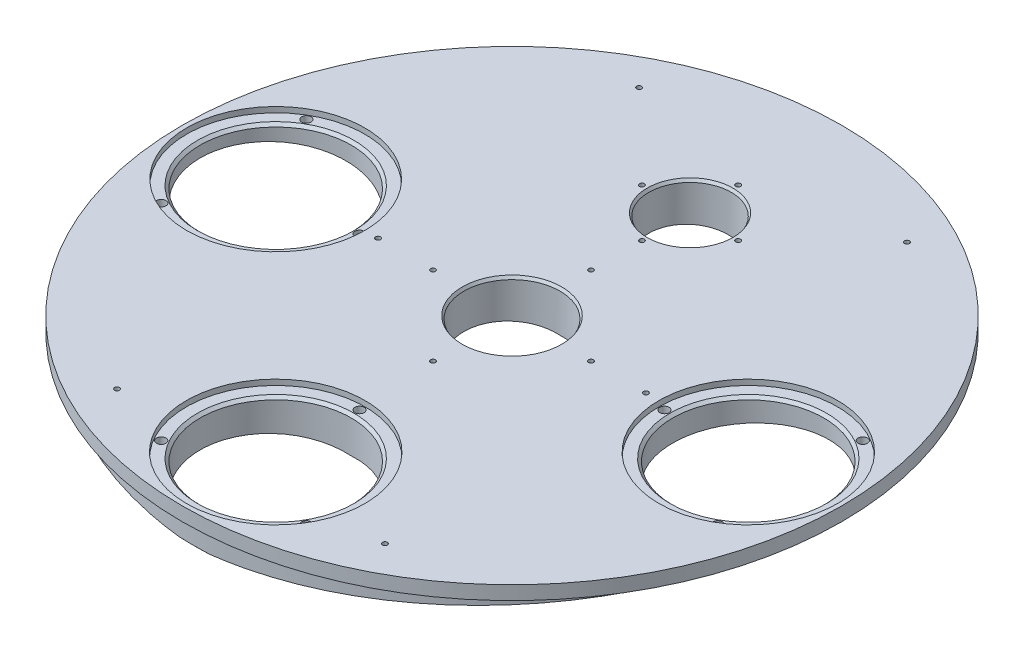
from build123d import *

# Parameters (mm, degrees)
SKETCH2_R                    = 152.4
EXTRUDE2_DEPTH               = 19.05
SKETCH1_R                    = 153.67
SKETCH1_R_2                  = 147.066
CUT_EXTRUDE3_DEPTH           = 12.7
FILLET1_R                    = 0.254
CHAMFER1_SIZE                = 0.508
SKETCH5_R                    = 34.925
CUT_EXTRUDE2_DEPTH           = 217.366407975
CUT_EXTRUDE4_DEPTH           = 12.7
CUT_EXTRUDE5_DEPTH           = 12.7
SKETCH8_R                    = 19.05
OPTODE_PORT_DEPTH            = 19.05
SKETCH9_R                    = 22.225
STIRER_PORT_DEPTH            = 19.05
F_4_40_TAPPED_HOLE2_D        = 2.2606
CIRPATTERN1_COUNT            = 4
CHAMFER2_SIZE                = 0.762
CHAMFER2_SIZE2               = 1.319822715
CHAMFER3_SIZE                = 0.762
CHAMFER3_SIZE2               = 1.319822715
F_4_40_TAPPED_HOLE1_D        = 2.2606
CIRPATTERN2_COUNT            = 4
F_18_0_1695_DIAMETER_HOLE1_D = 4.3053
CIRPATTERN3_COUNT            = 3
MIRROR1_COPY_1_D             = 4.3053
MIRROR1_COPY_2_D             = 4.3053
F_18_0_1695_DIAMETER_HOLE2_D = 4.3053
CIRPATTERN4_COUNT            = 3
F_4_40_TAPPED_HOLE3_D        = 2.2606
LPATTERN1_COUNT              = 2
LPATTERN1_PITCH              = 123.8504
LPATTERN1_COUNT_DIR2         = 3
LPATTERN1_PITCH_DIR2         = 120.65
CHAMFER4_SIZE                = 1.27
SKETCH21_R                   = 41.275
SKETCH21_R_2                 = 41.148
CUT_EXTRUDE8_DEPTH           = 2.54
CHAMFER5_SIZE                = 1.27


with BuildPart() as part:
    # Sketch2 → Extrude2 (new body)
    with BuildSketch(Plane(origin=(0, 0, 0), x_dir=(-1, 0, 0), z_dir=(0, 1, 0))):
        with Locations(Location((0, 0, 0), (0, 0, 270))):
            Circle(SKETCH2_R)
    extrude(amount=EXTRUDE2_DEPTH)

    # Sketch1 → Cut-Extrude3 (cut)
    with BuildSketch(Plane(origin=(0, 0, 0), x_dir=(1, 0, 0), z_dir=(0, 1, 0))):
        Circle(SKETCH1_R)
        with Locations(Location((0, 0, 0), (0, 0, 270))):
            Circle(SKETCH1_R_2, mode=Mode.SUBTRACT)
    extrude(amount=CUT_EXTRUDE3_DEPTH, mode=Mode.SUBTRACT)

    # Fillet1
    fillet1_edges = [part.edges().sort_by_distance(p)[0] for p in [
        (0, 12.7, -147.066),
    ]]
    fillet(fillet1_edges, radius=FILLET1_R)

    # Chamfer1
    chamfer1_edges = [part.edges().sort_by_distance(p)[0] for p in [
        (0, 0, -147.066),
    ]]
    chamfer(chamfer1_edges, length=CHAMFER1_SIZE)

    # Sketch5 → Cut-Extrude2 (cut, through all)
    with BuildSketch(Plane(origin=(0, 19.05, 0), x_dir=(-1, 0, 0), z_dir=(0, 1, 0))):
        with Locations(Location((109.22, 0, 0), (0, 0, 90))):
            Circle(SKETCH5_R)
        with Locations(Location((0, 109.22, 0), (0, 0, 90))):
            Circle(SKETCH5_R)
        with Locations(Location((-109.22, 0, 0), (0, 0, 90))):
            Circle(SKETCH5_R)
    extrude(amount=-CUT_EXTRUDE2_DEPTH, mode=Mode.SUBTRACT)

    # Sketch6 → Cut-Extrude4 (cut)
    with BuildSketch(Plane(origin=(0, 0, 0), x_dir=(-0.9975640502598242, 0.06975647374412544, 0), z_dir=(0.06975647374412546, 0.9975640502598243, 0))):
        with BuildLine():
            Line((152.4, -103.370510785), (152.4, 103.370510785))
            ThreePointArc((152.4, 103.370510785), (-184.15, 0), (152.4, -103.370510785))
        make_face()
    extrude(amount=-CUT_EXTRUDE4_DEPTH, mode=Mode.SUBTRACT)

    # Sketch7 → Cut-Extrude5 (cut)
    with BuildSketch(Plane(origin=(0, 0, 0), x_dir=(0.9975640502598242, 0.06975647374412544, 0), z_dir=(0.06975647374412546, -0.9975640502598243, 0))):
        with BuildLine():
            Line((152.4, -160.84908347), (152.4, 160.84908347))
            ThreePointArc((152.4, 160.84908347), (-221.581108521, 0), (152.4, -160.84908347))
        make_face()
    extrude(amount=CUT_EXTRUDE5_DEPTH, mode=Mode.SUBTRACT)

    # Sketch8 → Optode Port (cut)
    with BuildSketch(Plane(origin=(0, 19.05, 0), x_dir=(-1, 0, 0), z_dir=(0, 1, 0))):
        with Locations(Location((0, -82.296, 0), (0, 0, 90))):
            Circle(SKETCH8_R)
    extrude(amount=-OPTODE_PORT_DEPTH, mode=Mode.SUBTRACT)

    # Sketch9 → Stirer Port (cut)
    with BuildSketch(Plane(origin=(0, 19.05, 0), x_dir=(-1, 0, 0), z_dir=(0, 1, 0))):
        with Locations(Location((0, 0, 0), (0, 0, 90))):
            Circle(SKETCH9_R)
    extrude(amount=-STIRER_PORT_DEPTH, mode=Mode.SUBTRACT)

    # 4-40 Tapped Hole2 (through all)
    with Locations(Plane(origin=(0, 19.05, -104.521), x_dir=(0, 0, 1), z_dir=(0, 1, 0))):
        with Locations((0, 0)):
            f_4_40_tapped_hole2 = Hole(F_4_40_TAPPED_HOLE2_D / 2)

    # CirPattern1: 4-40 Tapped Hole2 ×4 about axis
    cirpattern1_axis = Axis((0, 0, -82.296), (0, 1, 0))
    for i in range(1, CIRPATTERN1_COUNT):
        add(f_4_40_tapped_hole2.rotate(cirpattern1_axis, i * 360 / CIRPATTERN1_COUNT), mode=Mode.SUBTRACT)

    # Chamfer2
    chamfer2_edges = [part.edges().sort_by_distance(p)[0] for p in [
        (0, 19.05, -101.346),
    ]]
    chamfer2_side = [part.faces().sort_by_distance(p)[0] for p in [
        (0, 19.05, 148.089477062),
    ]]
    chamfer(chamfer2_edges, length=CHAMFER2_SIZE, length2=CHAMFER2_SIZE2, reference=chamfer2_side[0])

    # Chamfer3
    chamfer3_edges = [part.edges().sort_by_distance(p)[0] for p in [
        (0, 19.05, -22.225),
    ]]
    chamfer3_side = [part.faces().sort_by_distance(p)[0] for p in [
        (0, 19.05, -106.418522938),
    ]]
    chamfer(chamfer3_edges, length=CHAMFER3_SIZE, length2=CHAMFER3_SIZE2, reference=chamfer3_side[0])

    # 4-40 Tapped Hole1 (through all)
    with Locations(Plane(origin=(0, 19.05, -36.5125), x_dir=(0, 0, 1), z_dir=(0, 1, 0))):
        with Locations((0, 0)):
            f_4_40_tapped_hole1 = Hole(F_4_40_TAPPED_HOLE1_D / 2)

    # CirPattern2: 4-40 Tapped Hole1 ×4 about axis
    cirpattern2_axis = Axis((0, 0, 0), (0, 1, 0))
    for i in range(1, CIRPATTERN2_COUNT):
        add(f_4_40_tapped_hole1.rotate(cirpattern2_axis, i * 360 / CIRPATTERN2_COUNT), mode=Mode.SUBTRACT)

    # 18 _0.1695_ Diameter Hole1 (through all)
    with Locations(Plane(origin=(-128.5875, 19.05, 33.545494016), x_dir=(0, 0, 1), z_dir=(0, 1, 0))):
        with Locations((0, 0)):
            f_18_0_1695_diameter_hole1 = Hole(F_18_0_1695_DIAMETER_HOLE1_D / 2)

    # CirPattern3: 18 _0.1695_ Diameter Hole1 ×3 about axis
    cirpattern3_axis = Axis((-109.22, 0, 0), (0, 1, 0))
    for i in range(1, CIRPATTERN3_COUNT):
        add(f_18_0_1695_diameter_hole1.rotate(cirpattern3_axis, i * 360 / CIRPATTERN3_COUNT), mode=Mode.SUBTRACT)

    # Mirror1: 18 _0.1695_ Diameter Hole1 across plane
    add(f_18_0_1695_diameter_hole1.mirror(Plane(origin=(0, 0, 0), x_dir=(0, 0, 1), z_dir=(1, 0, 0))), mode=Mode.SUBTRACT)

    # Mirror1 copy 1 (through all)
    with Locations(Plane(origin=(70.485, 19.05, 0), x_dir=(-0.8660254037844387, 0, -0.4999999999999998), z_dir=(0, 1, 0))):
        with Locations((0, 0)):
            Hole(MIRROR1_COPY_1_D / 2)

    # Mirror1 copy 2 (through all)
    with Locations(Plane(origin=(128.5875, 19.05, -33.545494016), x_dir=(0.8660254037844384, 0, -0.5000000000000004), z_dir=(0, 1, 0))):
        with Locations((0, 0)):
            Hole(MIRROR1_COPY_2_D / 2)

    # 18 _0.1695_ Diameter Hole2 (through all)
    with Locations(Plane(origin=(0, 19.05, 70.485), x_dir=(0, 0, 1), z_dir=(0, 1, 0))):
        with Locations((0, 0)):
            f_18_0_1695_diameter_hole2 = Hole(F_18_0_1695_DIAMETER_HOLE2_D / 2)

    # CirPattern4: 18 _0.1695_ Diameter Hole2 ×3 about axis
    cirpattern4_axis = Axis((0, 0, 109.22), (0, 1, 0))
    for i in range(1, CIRPATTERN4_COUNT):
        add(f_18_0_1695_diameter_hole2.rotate(cirpattern4_axis, i * 360 / CIRPATTERN4_COUNT), mode=Mode.SUBTRACT)

    # 4-40 Tapped Hole3 (through all)
    with Locations(Plane(origin=(61.9252, 19.05, -120.65), x_dir=(0, 0, 1), z_dir=(0, 1, 0))):
        with Locations((0, 0)):
            f_4_40_tapped_hole3 = Hole(F_4_40_TAPPED_HOLE3_D / 2)

    # LPattern1: 4-40 Tapped Hole3 2 × 3
    with Locations(*[(-i * LPATTERN1_PITCH, 0, j * LPATTERN1_PITCH_DIR2) for i in range(LPATTERN1_COUNT) for j in range(LPATTERN1_COUNT_DIR2) if (i, j) != (0, 0)]):
        add(f_4_40_tapped_hole3, mode=Mode.SUBTRACT)

    # Chamfer4
    chamfer4_edges = [part.edges().sort_by_distance(p)[0] for p in [
        (109.22, 19.05, -34.925),
        (0, 19.05, 74.295),
        (-109.22, 19.05, -34.925),
    ]]
    chamfer(chamfer4_edges, length=CHAMFER4_SIZE)

    # Sketch21 → Cut-Extrude8 (cut)
    with BuildSketch(Plane(origin=(0, 19.05, 0), x_dir=(-1, 0, 0), z_dir=(0, 1, 0))):
        with Locations(Location((0, 109.22, 0), (0, 0, 90))):
            Circle(SKETCH21_R)
        with Locations(Location((-109.22, 0, 0), (0, 0, 90))):
            Circle(SKETCH21_R)
        with Locations(Location((109.22, 0, 0), (0, 0, 90))):
            Circle(SKETCH21_R_2)
    extrude(amount=-CUT_EXTRUDE8_DEPTH, mode=Mode.SUBTRACT)

    # Chamfer5
    chamfer5_edges = [part.edges().sort_by_distance(p)[0] for p in [
        (0, 16.51, 74.295),
        (109.22, 16.51, -34.925),
        (-109.22, 16.51, -34.925),
    ]]
    chamfer(chamfer5_edges, length=CHAMFER5_SIZE)


solid = part.part
